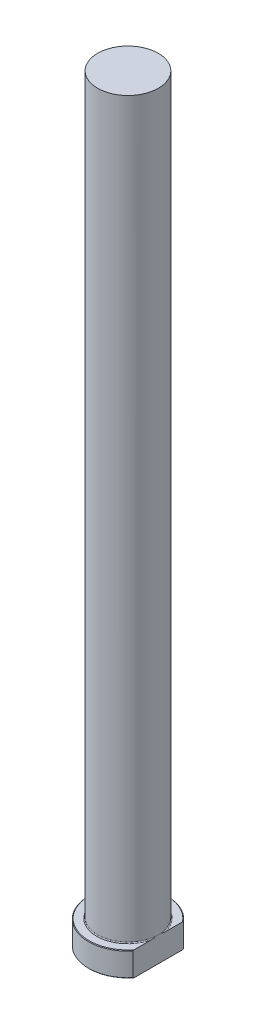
ISO-10303-21;
HEADER;
FILE_DESCRIPTION(('STEP AP214'),'2;1');
FILE_NAME('part.step','',(''),(''),'','','');
FILE_SCHEMA(('AUTOMOTIVE_DESIGN { 1 0 10303 214 1 1 1 1 }'));
ENDSEC;
DATA;
#1=APPLICATION_CONTEXT('core data for automotive mechanical design processes');
#2=APPLICATION_PROTOCOL_DEFINITION('international standard','automotive_design',2000,#1);
#3=PRODUCT_CONTEXT('',#1,'mechanical');
#4=PRODUCT('Part','Part','',(#3));
#5=PRODUCT_RELATED_PRODUCT_CATEGORY('part','',(#4));
#6=PRODUCT_DEFINITION_FORMATION('','',#4);
#7=PRODUCT_DEFINITION_CONTEXT('part definition',#1,'design');
#8=PRODUCT_DEFINITION('design','',#6,#7);
#9=PRODUCT_DEFINITION_SHAPE('','',#8);
#10=(LENGTH_UNIT() NAMED_UNIT(*) SI_UNIT(.MILLI.,.METRE.));
#11=(NAMED_UNIT(*) PLANE_ANGLE_UNIT() SI_UNIT($,.RADIAN.));
#12=(NAMED_UNIT(*) SI_UNIT($,.STERADIAN.) SOLID_ANGLE_UNIT());
#13=UNCERTAINTY_MEASURE_WITH_UNIT(LENGTH_MEASURE(1.E-05),#10,'distance_accuracy_value','');
#14=(GEOMETRIC_REPRESENTATION_CONTEXT(3) GLOBAL_UNCERTAINTY_ASSIGNED_CONTEXT((#13)) GLOBAL_UNIT_ASSIGNED_CONTEXT((#10,
#11,#12)) REPRESENTATION_CONTEXT('',''));
#15=CARTESIAN_POINT('',(0.,0.,0.));
#16=DIRECTION('',(0.,0.,1.));
#17=DIRECTION('',(1.,0.,0.));
#18=AXIS2_PLACEMENT_3D('',#15,#16,#17);
#19=CARTESIAN_POINT('',(0.,0.,0.));
#20=DIRECTION('',(0.,-1.,0.));
#21=DIRECTION('',(0.,0.,-1.));
#22=AXIS2_PLACEMENT_3D('',#19,#20,#21);
#23=PLANE('',#22);
#24=CARTESIAN_POINT('',(0.,0.,0.));
#25=DIRECTION('',(0.,-1.,0.));
#26=DIRECTION('',(0.,0.,-1.));
#27=AXIS2_PLACEMENT_3D('',#24,#25,#26);
#28=CIRCLE('',#27,12.8);
#29=CARTESIAN_POINT('',(9.99999999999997,0.,7.98999374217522));
#30=VERTEX_POINT('',#29);
#31=CARTESIAN_POINT('',(9.99999999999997,0.,-7.98999374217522));
#32=VERTEX_POINT('',#31);
#33=EDGE_CURVE('E98',#30,#32,#28,.T.);
#34=ORIENTED_EDGE('',*,*,#33,.T.);
#35=DIRECTION('',(0.,0.,1.));
#36=VECTOR('',#35,1.);
#37=CARTESIAN_POINT('',(9.99999999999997,0.,-8.30662386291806));
#38=LINE('',#37,#36);
#39=EDGE_CURVE('E83',#32,#30,#38,.T.);
#40=ORIENTED_EDGE('',*,*,#39,.T.);
#41=EDGE_LOOP('',(#34,#40));
#42=FACE_BOUND('',#41,.T.);
#43=ADVANCED_FACE('F32',(#42),#23,.T.);
#44=CARTESIAN_POINT('',(0.,259.958771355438,0.));
#45=DIRECTION('',(0.,1.,0.));
#46=DIRECTION('',(0.,0.,1.));
#47=AXIS2_PLACEMENT_3D('',#44,#45,#46);
#48=CYLINDRICAL_SURFACE('',#47,13.);
#49=CARTESIAN_POINT('',(0.,7.79999999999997,0.));
#50=DIRECTION('',(0.,1.,0.));
#51=DIRECTION('',(0.,0.,1.));
#52=AXIS2_PLACEMENT_3D('',#49,#50,#51);
#53=CIRCLE('',#52,13.);
#54=CARTESIAN_POINT('',(9.99999999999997,7.79999999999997,8.30662386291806));
#55=VERTEX_POINT('',#54);
#56=CARTESIAN_POINT('',(9.99999999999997,7.79999999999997,-8.30662386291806));
#57=VERTEX_POINT('',#56);
#58=EDGE_CURVE('E104',#55,#57,#53,.F.);
#59=ORIENTED_EDGE('',*,*,#58,.T.);
#60=DIRECTION('',(0.,-1.,0.));
#61=VECTOR('',#60,1.);
#62=CARTESIAN_POINT('',(9.99999999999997,250.,-8.30662386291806));
#63=LINE('',#62,#61);
#64=CARTESIAN_POINT('',(9.99999999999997,0.199999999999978,-8.30662386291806));
#65=VERTEX_POINT('',#64);
#66=EDGE_CURVE('E183',#57,#65,#63,.T.);
#67=ORIENTED_EDGE('',*,*,#66,.T.);
#68=CARTESIAN_POINT('',(0.,0.199999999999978,0.));
#69=DIRECTION('',(0.,-1.,0.));
#70=DIRECTION('',(0.,0.,-1.));
#71=AXIS2_PLACEMENT_3D('',#68,#69,#70);
#72=CIRCLE('',#71,13.);
#73=CARTESIAN_POINT('',(9.99999999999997,0.199999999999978,8.30662386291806));
#74=VERTEX_POINT('',#73);
#75=EDGE_CURVE('E100',#65,#74,#72,.F.);
#76=ORIENTED_EDGE('',*,*,#75,.T.);
#77=DIRECTION('',(0.,-1.,0.));
#78=VECTOR('',#77,1.);
#79=CARTESIAN_POINT('',(9.99999999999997,250.,8.30662386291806));
#80=LINE('',#79,#78);
#81=EDGE_CURVE('E93',#55,#74,#80,.T.);
#82=ORIENTED_EDGE('',*,*,#81,.F.);
#83=EDGE_LOOP('',(#59,#67,#76,#82));
#84=FACE_BOUND('',#83,.T.);
#85=ADVANCED_FACE('F158',(#84),#48,.T.);
#86=CARTESIAN_POINT('',(-13.,8.,0.));
#87=DIRECTION('',(0.,1.,0.));
#88=DIRECTION('',(0.,0.,1.));
#89=AXIS2_PLACEMENT_3D('',#86,#87,#88);
#90=PLANE('',#89);
#91=CARTESIAN_POINT('',(0.,8.,0.));
#92=DIRECTION('',(0.,1.,0.));
#93=DIRECTION('',(0.,0.,1.));
#94=AXIS2_PLACEMENT_3D('',#91,#92,#93);
#95=CIRCLE('',#94,12.8);
#96=CARTESIAN_POINT('',(9.99999999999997,8.,-7.98999374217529));
#97=VERTEX_POINT('',#96);
#98=CARTESIAN_POINT('',(9.99999999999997,8.,7.98999374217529));
#99=VERTEX_POINT('',#98);
#100=EDGE_CURVE('E178',#97,#99,#95,.T.);
#101=ORIENTED_EDGE('',*,*,#100,.T.);
#102=DIRECTION('',(0.,0.,-1.));
#103=VECTOR('',#102,1.);
#104=CARTESIAN_POINT('',(9.99999999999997,8.,0.));
#105=LINE('',#104,#103);
#106=CARTESIAN_POINT('',(9.99999999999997,7.99999999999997,2.46779253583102));
#107=VERTEX_POINT('',#106);
#108=EDGE_CURVE('E57',#99,#107,#105,.T.);
#109=ORIENTED_EDGE('',*,*,#108,.T.);
#110=CARTESIAN_POINT('',(0.,8.,0.));
#111=DIRECTION('',(0.,1.,0.));
#112=DIRECTION('',(0.,0.,1.));
#113=AXIS2_PLACEMENT_3D('',#110,#111,#112);
#114=CIRCLE('',#113,10.3);
#115=CARTESIAN_POINT('',(9.99999999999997,7.99999999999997,-2.4677925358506));
#116=VERTEX_POINT('',#115);
#117=EDGE_CURVE('E107',#107,#116,#114,.F.);
#118=ORIENTED_EDGE('',*,*,#117,.T.);
#119=EDGE_CURVE('E136',#116,#97,#105,.T.);
#120=ORIENTED_EDGE('',*,*,#119,.T.);
#121=EDGE_LOOP('',(#101,#109,#118,#120));
#122=FACE_BOUND('',#121,.T.);
#123=ADVANCED_FACE('F147',(#122),#90,.T.);
#124=CARTESIAN_POINT('',(0.,8.00000000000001,0.));
#125=DIRECTION('',(0.,-1.,0.));
#126=DIRECTION('',(0.,0.,-1.));
#127=AXIS2_PLACEMENT_3D('',#124,#125,#126);
#128=CONICAL_SURFACE('',#127,12.8,0.78539816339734);
#129=ORIENTED_EDGE('',*,*,#58,.F.);
#130=CARTESIAN_POINT('',(9.99999999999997,-0.0325156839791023,18.2754947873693));
#131=CARTESIAN_POINT('',(9.99999999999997,0.202654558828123,18.0074110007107));
#132=CARTESIAN_POINT('',(9.99999999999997,0.437161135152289,17.7387434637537));
#133=CARTESIAN_POINT('',(9.99999999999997,0.90465320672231,17.2000818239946));
#134=CARTESIAN_POINT('',(9.99999999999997,1.1376386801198,16.9300877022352));
#135=CARTESIAN_POINT('',(9.99999999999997,1.60198918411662,16.3885035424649));
#136=CARTESIAN_POINT('',(9.99999999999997,1.83335346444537,16.1169128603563));
#137=CARTESIAN_POINT('',(9.99999999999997,2.29410614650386,15.5720644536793));
#138=CARTESIAN_POINT('',(9.99999999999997,2.52349455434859,15.2988067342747));
#139=CARTESIAN_POINT('',(9.99999999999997,3.21725580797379,14.465453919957));
#140=CARTESIAN_POINT('',(9.99999999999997,3.67808931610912,13.9023903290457));
#141=CARTESIAN_POINT('',(9.99999999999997,4.35978968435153,13.0502618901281));
#142=CARTESIAN_POINT('',(9.99999999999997,4.58540795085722,12.7649943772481));
#143=CARTESIAN_POINT('',(9.99999999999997,5.03290011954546,12.1915402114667));
#144=CARTESIAN_POINT('',(9.99999999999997,5.25477408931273,11.9033536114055));
#145=CARTESIAN_POINT('',(9.99999999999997,5.69431250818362,11.3233226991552));
#146=CARTESIAN_POINT('',(9.99999999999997,5.91197246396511,11.0314749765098));
#147=CARTESIAN_POINT('',(9.99999999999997,6.3419766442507,10.4438760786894));
#148=CARTESIAN_POINT('',(9.99999999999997,6.55432081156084,10.1481248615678));
#149=CARTESIAN_POINT('',(9.99999999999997,6.97275454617,9.55185224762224));
#150=CARTESIAN_POINT('',(9.99999999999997,7.1788387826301,9.25132709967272));
#151=CARTESIAN_POINT('',(9.99999999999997,7.58314110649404,8.6450223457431));
#152=CARTESIAN_POINT('',(9.99999999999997,7.78135936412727,8.33924285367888));
#153=CARTESIAN_POINT('',(9.99999999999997,8.1669913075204,7.72335702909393));
#154=CARTESIAN_POINT('',(9.99999999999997,8.35446043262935,7.41328556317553));
#155=CARTESIAN_POINT('',(9.99999999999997,8.71750578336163,6.78616658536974));
#156=CARTESIAN_POINT('',(9.99999999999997,8.89308056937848,6.46911823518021));
#157=CARTESIAN_POINT('',(9.99999999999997,9.22907765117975,5.82759086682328));
#158=CARTESIAN_POINT('',(9.99999999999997,9.38952050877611,5.50312269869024));
#159=CARTESIAN_POINT('',(9.99999999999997,9.69166927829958,4.84563633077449));
#160=CARTESIAN_POINT('',(9.99999999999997,9.83338220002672,4.5126213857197));
#161=CARTESIAN_POINT('',(9.99999999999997,10.096522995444,3.82962418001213));
#162=CARTESIAN_POINT('',(9.99999999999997,10.2174003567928,3.47942732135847));
#163=CARTESIAN_POINT('',(9.99999999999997,10.4289934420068,2.76986167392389));
#164=CARTESIAN_POINT('',(9.99999999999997,10.5197138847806,2.41049432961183));
#165=CARTESIAN_POINT('',(9.99999999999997,10.6286544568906,1.86748514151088));
#166=CARTESIAN_POINT('',(9.99999999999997,10.6603769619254,1.68649705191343));
#167=CARTESIAN_POINT('',(9.99999999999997,10.7144435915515,1.32313476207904));
#168=CARTESIAN_POINT('',(9.99999999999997,10.7367891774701,1.14076078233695));
#169=CARTESIAN_POINT('',(9.99999999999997,10.7716587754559,0.775084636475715));
#170=CARTESIAN_POINT('',(9.99999999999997,10.7841833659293,0.591782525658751));
#171=CARTESIAN_POINT('',(9.99999999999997,10.7991548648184,0.224764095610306));
#172=CARTESIAN_POINT('',(9.99999999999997,10.8016017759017,0.0410477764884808));
#173=CARTESIAN_POINT('',(9.99999999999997,10.7963538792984,-0.32701731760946));
#174=CARTESIAN_POINT('',(9.99999999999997,10.7886160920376,-0.511365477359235));
#175=CARTESIAN_POINT('',(9.99999999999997,10.7630873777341,-0.879387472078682));
#176=CARTESIAN_POINT('',(9.99999999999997,10.7452949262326,-1.06306120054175));
#177=CARTESIAN_POINT('',(9.99999999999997,10.7000178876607,-1.42920996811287));
#178=CARTESIAN_POINT('',(9.99999999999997,10.6725330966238,-1.61168498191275));
#179=CARTESIAN_POINT('',(9.99999999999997,10.6083992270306,-1.97502817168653));
#180=CARTESIAN_POINT('',(9.99999999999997,10.5717486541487,-2.15589608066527));
#181=CARTESIAN_POINT('',(9.99999999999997,10.4483311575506,-2.69844589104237));
#182=CARTESIAN_POINT('',(9.99999999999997,10.3484702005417,-3.0571987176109));
#183=CARTESIAN_POINT('',(9.99999999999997,10.1199208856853,-3.76518322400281));
#184=CARTESIAN_POINT('',(9.99999999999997,9.99123071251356,-4.11441430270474));
#185=CARTESIAN_POINT('',(9.99999999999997,9.68849468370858,-4.85781703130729));
#186=CARTESIAN_POINT('',(9.99999999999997,9.51049481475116,-5.25036497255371));
#187=CARTESIAN_POINT('',(9.99999999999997,9.13067200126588,-6.0238543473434));
#188=CARTESIAN_POINT('',(9.99999999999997,8.92883580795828,-6.40478917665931));
#189=CARTESIAN_POINT('',(9.99999999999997,8.50660482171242,-7.15714025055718));
#190=CARTESIAN_POINT('',(9.99999999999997,8.28617401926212,-7.52853612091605));
#191=CARTESIAN_POINT('',(9.99999999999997,7.83133827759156,-8.26251132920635));
#192=CARTESIAN_POINT('',(9.99999999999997,7.59693601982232,-8.62509234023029));
#193=CARTESIAN_POINT('',(9.99999999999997,7.11586721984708,-9.34492022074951));
#194=CARTESIAN_POINT('',(9.99999999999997,6.86913954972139,-9.7021260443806));
#195=CARTESIAN_POINT('',(9.99999999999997,6.36695123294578,-10.4103413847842));
#196=CARTESIAN_POINT('',(9.99999999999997,6.11149026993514,-10.7613506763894));
#197=CARTESIAN_POINT('',(9.99999999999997,5.59387477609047,-11.4577672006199));
#198=CARTESIAN_POINT('',(9.99999999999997,5.33172815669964,-11.803180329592));
#199=CARTESIAN_POINT('',(9.99999999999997,4.80177954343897,-12.4896197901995));
#200=CARTESIAN_POINT('',(9.99999999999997,4.53397765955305,-12.8306462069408));
#201=CARTESIAN_POINT('',(9.99999999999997,3.91508653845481,-13.6077378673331));
#202=CARTESIAN_POINT('',(9.99999999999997,3.56244770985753,-14.0425677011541));
#203=CARTESIAN_POINT('',(9.99999999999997,2.85099084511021,-14.9072873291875));
#204=CARTESIAN_POINT('',(9.99999999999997,2.49217148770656,-15.3371760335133));
#205=CARTESIAN_POINT('',(9.99999999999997,1.77449197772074,-16.1870689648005));
#206=CARTESIAN_POINT('',(9.99999999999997,1.41569709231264,-16.607128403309));
#207=CARTESIAN_POINT('',(9.99999999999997,0.694277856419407,-17.4437464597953));
#208=CARTESIAN_POINT('',(9.99999999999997,0.331654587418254,-17.8603060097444));
#209=CARTESIAN_POINT('',(9.99999999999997,-0.0325156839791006,-18.2754947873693));
#210=B_SPLINE_CURVE_WITH_KNOTS('',3,(#130,#131,#132,#133,#134,#135,#136,#137,#138,#139,#140,
#141,#142,#143,#144,#145,#146,#147,#148,#149,#150,#151,#152,#153,#154,#155,#156,#157,#158,#159,
#160,#161,#162,#163,#164,#165,#166,#167,#168,#169,#170,#171,#172,#173,#174,#175,#176,#177,#178,
#179,#180,#181,#182,#183,#184,#185,#186,#187,#188,#189,#190,#191,#192,#193,#194,#195,#196,#197,
#198,#199,#200,#201,#202,#203,#204,#205,#206,#207,#208,#209),.UNSPECIFIED.,.F.,.F.,(4,2,2,2,2,2,
2,2,2,2,2,2,2,2,2,2,2,2,2,2,2,2,2,2,2,2,2,2,2,2,2,2,2,2,2,2,2,2,2,4),(0.,1.06984422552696,
2.13970378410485,3.21002948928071,4.28035188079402,6.46299853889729,7.55408928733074,
8.64516032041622,9.73733693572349,10.8295252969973,11.9226190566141,13.0156891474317,
14.1024911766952,15.1894245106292,16.2748589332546,17.3598859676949,18.4702319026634,
19.5804040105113,20.1314403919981,20.6823908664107,21.2333088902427,21.7842267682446,
22.3374769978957,22.890811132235,23.4441569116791,23.9975929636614,25.1131246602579,
26.2287266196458,27.520697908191,28.8133907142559,30.1086470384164,31.4036555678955,
32.7058891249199,34.0081699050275,35.3089752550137,36.6097553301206,38.2892289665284,
39.9690662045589,41.6263430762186,43.2831636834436),.UNSPECIFIED.);
#211=EDGE_CURVE('E135',#55,#99,#210,.T.);
#212=ORIENTED_EDGE('',*,*,#211,.T.);
#213=ORIENTED_EDGE('',*,*,#100,.F.);
#214=EDGE_CURVE('E127',#97,#57,#210,.T.);
#215=ORIENTED_EDGE('',*,*,#214,.T.);
#216=EDGE_LOOP('',(#129,#212,#213,#215));
#217=FACE_BOUND('',#216,.T.);
#218=ADVANCED_FACE('F143',(#217),#128,.T.);
#219=CARTESIAN_POINT('',(0.,0.199999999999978,0.));
#220=DIRECTION('',(0.,1.,0.));
#221=DIRECTION('',(0.,0.,1.));
#222=AXIS2_PLACEMENT_3D('',#219,#220,#221);
#223=CONICAL_SURFACE('',#222,13.,0.785398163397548);
#224=ORIENTED_EDGE('',*,*,#75,.F.);
#225=CARTESIAN_POINT('',(9.99999999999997,8.0325156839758,-18.2754947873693));
#226=CARTESIAN_POINT('',(9.99999999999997,7.7973454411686,-18.0074110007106));
#227=CARTESIAN_POINT('',(9.99999999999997,7.56283886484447,-17.7387434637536));
#228=CARTESIAN_POINT('',(9.99999999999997,7.09534679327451,-17.2000818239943));
#229=CARTESIAN_POINT('',(9.99999999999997,6.86236131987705,-16.9300877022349));
#230=CARTESIAN_POINT('',(9.99999999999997,6.3980108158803,-16.3885035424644));
#231=CARTESIAN_POINT('',(9.99999999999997,6.16664653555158,-16.1169128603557));
#232=CARTESIAN_POINT('',(9.99999999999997,5.70589385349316,-15.5720644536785));
#233=CARTESIAN_POINT('',(9.99999999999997,5.47650544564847,-15.2988067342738));
#234=CARTESIAN_POINT('',(9.99999999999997,4.78274419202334,-14.4654539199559));
#235=CARTESIAN_POINT('',(9.99999999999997,4.32191068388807,-13.9023903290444));
#236=CARTESIAN_POINT('',(9.99999999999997,3.64021031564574,-13.0502618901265));
#237=CARTESIAN_POINT('',(9.99999999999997,3.41459204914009,-12.7649943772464));
#238=CARTESIAN_POINT('',(9.99999999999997,2.96709988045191,-12.1915402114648));
#239=CARTESIAN_POINT('',(9.99999999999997,2.74522591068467,-11.9033536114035));
#240=CARTESIAN_POINT('',(9.99999999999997,2.30568749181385,-11.323322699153));
#241=CARTESIAN_POINT('',(9.99999999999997,2.08802753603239,-11.0314749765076));
#242=CARTESIAN_POINT('',(9.99999999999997,1.65802335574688,-10.4438760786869));
#243=CARTESIAN_POINT('',(9.99999999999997,1.44567918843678,-10.1481248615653));
#244=CARTESIAN_POINT('',(9.99999999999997,1.02724545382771,-9.5518522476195));
#245=CARTESIAN_POINT('',(9.99999999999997,0.821161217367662,-9.25132709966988));
#246=CARTESIAN_POINT('',(9.99999999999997,0.416858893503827,-8.64502234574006));
#247=CARTESIAN_POINT('',(9.99999999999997,0.218640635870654,-8.33924285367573));
#248=CARTESIAN_POINT('',(9.99999999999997,-0.166991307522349,-7.72335702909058));
#249=CARTESIAN_POINT('',(9.99999999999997,-0.35446043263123,-7.41328556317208));
#250=CARTESIAN_POINT('',(9.99999999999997,-0.717505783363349,-6.78616658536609));
#251=CARTESIAN_POINT('',(9.99999999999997,-0.89308056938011,-6.46911823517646));
#252=CARTESIAN_POINT('',(9.99999999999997,-1.2290776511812,-5.82759086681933));
#253=CARTESIAN_POINT('',(9.99999999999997,-1.38952050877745,-5.50312269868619));
#254=CARTESIAN_POINT('',(9.99999999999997,-1.6916692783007,-4.84563633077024));
#255=CARTESIAN_POINT('',(9.99999999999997,-1.83338220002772,-4.51262138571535));
#256=CARTESIAN_POINT('',(9.99999999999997,-2.09652299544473,-3.8296241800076));
#257=CARTESIAN_POINT('',(9.99999999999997,-2.21740035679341,-3.47942732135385));
#258=CARTESIAN_POINT('',(9.99999999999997,-2.42899344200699,-2.76986167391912));
#259=CARTESIAN_POINT('',(9.99999999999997,-2.51971388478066,-2.41049432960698));
#260=CARTESIAN_POINT('',(9.99999999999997,-2.62865445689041,-1.86748514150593));
#261=CARTESIAN_POINT('',(9.99999999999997,-2.66037696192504,-1.68649705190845));
#262=CARTESIAN_POINT('',(9.99999999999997,-2.71444359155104,-1.323134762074));
#263=CARTESIAN_POINT('',(9.99999999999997,-2.73678917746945,-1.14076078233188));
#264=CARTESIAN_POINT('',(9.99999999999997,-2.77165877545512,-0.775084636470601));
#265=CARTESIAN_POINT('',(9.99999999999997,-2.78418336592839,-0.591782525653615));
#266=CARTESIAN_POINT('',(9.99999999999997,-2.7991548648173,-0.224764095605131));
#267=CARTESIAN_POINT('',(9.99999999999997,-2.80160177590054,-0.0410477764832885));
#268=CARTESIAN_POINT('',(9.99999999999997,-2.79635387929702,0.327017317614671));
#269=CARTESIAN_POINT('',(9.99999999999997,-2.78861609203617,0.511365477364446));
#270=CARTESIAN_POINT('',(9.99999999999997,-2.76308737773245,0.879387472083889));
#271=CARTESIAN_POINT('',(9.99999999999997,-2.74529492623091,1.06306120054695));
#272=CARTESIAN_POINT('',(9.99999999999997,-2.70001788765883,1.42920996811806));
#273=CARTESIAN_POINT('',(9.99999999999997,-2.67253309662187,1.61168498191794));
#274=CARTESIAN_POINT('',(9.99999999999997,-2.60839922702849,1.9750281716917));
#275=CARTESIAN_POINT('',(9.99999999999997,-2.57174865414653,2.15589608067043));
#276=CARTESIAN_POINT('',(9.99999999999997,-2.44833115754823,2.6984458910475));
#277=CARTESIAN_POINT('',(9.99999999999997,-2.34847020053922,3.057198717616));
#278=CARTESIAN_POINT('',(9.99999999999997,-2.11992088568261,3.76518322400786));
#279=CARTESIAN_POINT('',(9.99999999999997,-1.99123071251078,4.11441430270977));
#280=CARTESIAN_POINT('',(9.99999999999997,-1.68849468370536,4.85781703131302));
#281=CARTESIAN_POINT('',(9.99999999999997,-1.51049481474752,5.25036497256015));
#282=CARTESIAN_POINT('',(9.99999999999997,-1.13067200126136,6.02385434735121));
#283=CARTESIAN_POINT('',(9.99999999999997,-0.928835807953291,6.4047891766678));
#284=CARTESIAN_POINT('',(9.99999999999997,-0.506604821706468,7.15714025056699));
#285=CARTESIAN_POINT('',(9.99999999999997,-0.286174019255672,7.52853612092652));
#286=CARTESIAN_POINT('',(9.99999999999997,0.16866172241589,8.26251132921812));
#287=CARTESIAN_POINT('',(9.99999999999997,0.403063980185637,8.62509234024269));
#288=CARTESIAN_POINT('',(9.99999999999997,0.884132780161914,9.34492022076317));
#289=CARTESIAN_POINT('',(9.99999999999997,1.13086045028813,9.7021260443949));
#290=CARTESIAN_POINT('',(9.99999999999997,1.63304876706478,10.4103413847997));
#291=CARTESIAN_POINT('',(9.99999999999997,1.88850973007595,10.7613506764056));
#292=CARTESIAN_POINT('',(9.99999999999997,2.40612522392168,11.4577672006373));
#293=CARTESIAN_POINT('',(9.99999999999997,2.66827184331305,11.80318032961));
#294=CARTESIAN_POINT('',(9.99999999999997,3.19822045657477,12.4896197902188));
#295=CARTESIAN_POINT('',(9.99999999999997,3.46602234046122,12.8306462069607));
#296=CARTESIAN_POINT('',(9.99999999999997,4.08491346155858,13.6077378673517));
#297=CARTESIAN_POINT('',(9.99999999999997,4.4375522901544,14.042567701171));
#298=CARTESIAN_POINT('',(9.99999999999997,5.14900915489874,14.9072873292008));
#299=CARTESIAN_POINT('',(9.99999999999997,5.50782851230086,15.3371760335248));
#300=CARTESIAN_POINT('',(9.99999999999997,6.22550802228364,16.1870689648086));
#301=CARTESIAN_POINT('',(9.99999999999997,6.58430290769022,16.6071284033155));
#302=CARTESIAN_POINT('',(9.99999999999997,7.30572214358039,17.4437464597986));
#303=CARTESIAN_POINT('',(9.99999999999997,7.66834541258,17.8603060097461));
#304=CARTESIAN_POINT('',(9.99999999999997,8.0325156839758,18.2754947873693));
#305=B_SPLINE_CURVE_WITH_KNOTS('',3,(#225,#226,#227,#228,#229,#230,#231,#232,#233,#234,#235,
#236,#237,#238,#239,#240,#241,#242,#243,#244,#245,#246,#247,#248,#249,#250,#251,#252,#253,#254,
#255,#256,#257,#258,#259,#260,#261,#262,#263,#264,#265,#266,#267,#268,#269,#270,#271,#272,#273,
#274,#275,#276,#277,#278,#279,#280,#281,#282,#283,#284,#285,#286,#287,#288,#289,#290,#291,#292,
#293,#294,#295,#296,#297,#298,#299,#300,#301,#302,#303,#304),.UNSPECIFIED.,.F.,.F.,(4,2,2,2,2,2,
2,2,2,2,2,2,2,2,2,2,2,2,2,2,2,2,2,2,2,2,2,2,2,2,2,2,2,2,2,2,2,2,2,4),(0.,1.06984422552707,
2.13970378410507,3.21002948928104,4.28035188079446,6.46299853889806,7.55408928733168,
8.64516032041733,9.73733693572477,10.8295252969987,11.9226190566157,13.0156891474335,
14.1024911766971,15.1894245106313,16.2748589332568,17.3598859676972,18.4702319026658,
19.5804040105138,20.1314403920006,20.6823908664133,21.2333088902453,21.7842267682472,
22.3374769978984,22.8908111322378,23.4441569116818,23.9975929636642,25.1131246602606,
26.2287266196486,27.5206979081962,28.8133907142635,30.1086470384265,31.4036555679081,
32.7058891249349,34.0081699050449,35.3089752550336,36.6097553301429,38.2892289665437,
39.9690662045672,41.6263430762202,43.2831636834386),.UNSPECIFIED.);
#306=EDGE_CURVE('E86',#65,#32,#305,.T.);
#307=ORIENTED_EDGE('',*,*,#306,.T.);
#308=ORIENTED_EDGE('',*,*,#33,.F.);
#309=EDGE_CURVE('E89',#30,#74,#305,.T.);
#310=ORIENTED_EDGE('',*,*,#309,.T.);
#311=EDGE_LOOP('',(#224,#307,#308,#310));
#312=FACE_BOUND('',#311,.T.);
#313=ADVANCED_FACE('F97',(#312),#223,.T.);
#314=CARTESIAN_POINT('',(0.,8.29999999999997,0.));
#315=DIRECTION('',(0.,1.,0.));
#316=DIRECTION('',(0.,0.,1.));
#317=AXIS2_PLACEMENT_3D('',#314,#315,#316);
#318=TOROIDAL_SURFACE('',#317,10.3,0.3);
#319=CARTESIAN_POINT('',(9.99999999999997,8.29999999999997,0.));
#320=CARTESIAN_POINT('',(9.99999999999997,8.3000006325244,1.2894927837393E-10));
#321=CARTESIAN_POINT('',(9.99999999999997,8.30000126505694,-4.00092931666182E-07));
#322=CARTESIAN_POINT('',(9.99999999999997,8.30000243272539,-1.40234418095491E-06));
#323=CARTESIAN_POINT('',(9.99999999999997,8.30000291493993,-2.02945823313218E-06));
#324=CARTESIAN_POINT('',(9.99999999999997,8.30000399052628,-3.57386628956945E-06));
#325=CARTESIAN_POINT('',(9.99999999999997,8.30000456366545,-4.5158581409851E-06));
#326=CARTESIAN_POINT('',(9.99999999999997,8.30000552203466,-6.39352358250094E-06));
#327=CARTESIAN_POINT('',(9.99999999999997,8.3000059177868,-7.32481303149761E-06));
#328=CARTESIAN_POINT('',(9.99999999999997,8.30000752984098,-1.11866731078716E-05));
#329=CARTESIAN_POINT('',(9.99999999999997,8.30000869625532,-1.41456078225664E-05));
#330=CARTESIAN_POINT('',(9.99999999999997,8.30001046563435,-1.98041770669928E-05));
#331=CARTESIAN_POINT('',(9.99999999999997,8.30001112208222,-2.2487618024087E-05));
#332=CARTESIAN_POINT('',(9.99999999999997,8.30001410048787,-3.44834818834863E-05));
#333=CARTESIAN_POINT('',(9.99999999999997,8.30001652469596,-4.37702043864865E-05));
#334=CARTESIAN_POINT('',(9.99999999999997,8.30001986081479,-6.08623690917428E-05));
#335=CARTESIAN_POINT('',(9.99999999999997,8.30002096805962,-6.86285921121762E-05));
#336=CARTESIAN_POINT('',(9.99999999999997,8.3000293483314,-0.00012805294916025));
#337=CARTESIAN_POINT('',(9.99999999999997,8.30003610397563,-0.000179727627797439));
#338=CARTESIAN_POINT('',(9.99999999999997,8.30006561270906,-0.00038619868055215));
#339=CARTESIAN_POINT('',(9.99999999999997,8.30009331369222,-0.000540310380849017));
#340=CARTESIAN_POINT('',(9.99999999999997,8.30020264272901,-0.00115673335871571));
#341=CARTESIAN_POINT('',(9.99999999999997,8.30028138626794,-0.00161935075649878));
#342=CARTESIAN_POINT('',(9.99999999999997,8.30059961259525,-0.00347761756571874));
#343=CARTESIAN_POINT('',(9.99999999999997,8.30084290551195,-0.0048728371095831));
#344=CARTESIAN_POINT('',(9.99999999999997,8.30186502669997,-0.0107472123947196));
#345=CARTESIAN_POINT('',(9.99999999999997,8.30263902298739,-0.0152269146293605));
#346=CARTESIAN_POINT('',(9.99999999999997,8.31278939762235,-0.0739588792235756));
#347=CARTESIAN_POINT('',(9.99999999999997,8.32219581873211,-0.128207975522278));
#348=CARTESIAN_POINT('',(9.99999999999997,8.34198671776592,-0.242894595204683));
#349=CARTESIAN_POINT('',(9.99999999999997,8.35236068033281,-0.303333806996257));
#350=CARTESIAN_POINT('',(9.99999999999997,8.3697713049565,-0.405616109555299));
#351=CARTESIAN_POINT('',(9.99999999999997,8.3768514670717,-0.447451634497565));
#352=CARTESIAN_POINT('',(9.99999999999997,8.39069208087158,-0.529918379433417));
#353=CARTESIAN_POINT('',(9.99999999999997,8.39745582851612,-0.570549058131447));
#354=CARTESIAN_POINT('',(9.99999999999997,8.4352494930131,-0.799879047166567));
#355=CARTESIAN_POINT('',(9.99999999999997,8.46492511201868,-0.988816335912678));
#356=CARTESIAN_POINT('',(9.99999999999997,8.50514159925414,-1.27416595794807));
#357=CARTESIAN_POINT('',(9.99999999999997,8.51790226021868,-1.37026272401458));
#358=CARTESIAN_POINT('',(9.99999999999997,8.54137601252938,-1.56269877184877));
#359=CARTESIAN_POINT('',(9.99999999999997,8.55208934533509,-1.65903802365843));
#360=CARTESIAN_POINT('',(9.99999999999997,8.57171635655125,-1.86082905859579));
#361=CARTESIAN_POINT('',(9.99999999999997,8.58037484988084,-1.96630619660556));
#362=CARTESIAN_POINT('',(9.99999999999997,8.59347501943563,-2.17764173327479));
#363=CARTESIAN_POINT('',(9.99999999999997,8.59791297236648,-2.28350038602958));
#364=CARTESIAN_POINT('',(9.99999999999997,8.60018116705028,-2.44194031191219));
#365=CARTESIAN_POINT('',(9.99999999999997,8.60021412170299,-2.49449016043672));
#366=CARTESIAN_POINT('',(9.99999999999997,8.5985468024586,-2.59955991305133));
#367=CARTESIAN_POINT('',(9.99999999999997,8.59684676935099,-2.65207982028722));
#368=CARTESIAN_POINT('',(9.99999999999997,8.59132943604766,-2.7569292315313));
#369=CARTESIAN_POINT('',(9.99999999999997,8.58751547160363,-2.80925890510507));
#370=CARTESIAN_POINT('',(9.99999999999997,8.57721394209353,-2.91364681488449));
#371=CARTESIAN_POINT('',(9.99999999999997,8.57072778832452,-2.96570517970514));
#372=CARTESIAN_POINT('',(9.99999999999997,8.55845909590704,-3.04236198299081));
#373=CARTESIAN_POINT('',(9.99999999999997,8.55406015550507,-3.06718232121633));
#374=CARTESIAN_POINT('',(9.99999999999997,8.54426309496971,-3.11664708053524));
#375=CARTESIAN_POINT('',(9.99999999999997,8.53886425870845,-3.14129136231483));
#376=CARTESIAN_POINT('',(9.99999999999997,8.52688550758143,-3.19015398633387));
#377=CARTESIAN_POINT('',(9.99999999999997,8.52031210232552,-3.21437390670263));
#378=CARTESIAN_POINT('',(9.99999999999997,8.50565284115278,-3.26234404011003));
#379=CARTESIAN_POINT('',(9.99999999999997,8.49756823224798,-3.2860946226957));
#380=CARTESIAN_POINT('',(9.99999999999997,8.47930616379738,-3.33303874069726));
#381=CARTESIAN_POINT('',(9.99999999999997,8.46910978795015,-3.35622496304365));
#382=CARTESIAN_POINT('',(9.99999999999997,8.44583688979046,-3.40109767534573));
#383=CARTESIAN_POINT('',(9.99999999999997,8.43277518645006,-3.4227911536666));
#384=CARTESIAN_POINT('',(9.99999999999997,8.41234422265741,-3.44947282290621));
#385=CARTESIAN_POINT('',(9.99999999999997,8.40696910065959,-3.45597309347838));
#386=CARTESIAN_POINT('',(9.99999999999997,8.39560437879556,-3.46843629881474));
#387=CARTESIAN_POINT('',(9.99999999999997,8.38961405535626,-3.47439858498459));
#388=CARTESIAN_POINT('',(9.99999999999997,8.37686927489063,-3.48560282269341));
#389=CARTESIAN_POINT('',(9.99999999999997,8.37010747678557,-3.49083658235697));
#390=CARTESIAN_POINT('',(9.99999999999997,8.3558159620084,-3.50012893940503));
#391=CARTESIAN_POINT('',(9.99999999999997,8.34828839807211,-3.50419071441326));
#392=CARTESIAN_POINT('',(9.99999999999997,8.33495256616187,-3.50966904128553));
#393=CARTESIAN_POINT('',(9.99999999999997,8.32932210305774,-3.5115146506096));
#394=CARTESIAN_POINT('',(9.99999999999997,8.31783314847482,-3.51424608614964));
#395=CARTESIAN_POINT('',(9.99999999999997,8.31197492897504,-3.5151330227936));
#396=CARTESIAN_POINT('',(9.99999999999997,8.30017128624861,-3.51585458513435));
#397=CARTESIAN_POINT('',(9.99999999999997,8.29422562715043,-3.5156854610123));
#398=CARTESIAN_POINT('',(9.99999999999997,8.28245600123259,-3.5143060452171));
#399=CARTESIAN_POINT('',(9.99999999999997,8.2766321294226,-3.51309496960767));
#400=CARTESIAN_POINT('',(9.99999999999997,8.26408629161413,-3.50941038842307));
#401=CARTESIAN_POINT('',(9.99999999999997,8.25742641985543,-3.50672823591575));
#402=CARTESIAN_POINT('',(9.99999999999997,8.2446282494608,-3.50032629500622));
#403=CARTESIAN_POINT('',(9.99999999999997,8.23849100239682,-3.49660447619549));
#404=CARTESIAN_POINT('',(9.99999999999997,8.22322836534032,-3.48593836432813));
#405=CARTESIAN_POINT('',(9.99999999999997,8.21452212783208,-3.47840118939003));
#406=CARTESIAN_POINT('',(9.99999999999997,8.19829740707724,-3.46215047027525));
#407=CARTESIAN_POINT('',(9.99999999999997,8.19078248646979,-3.45343353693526));
#408=CARTESIAN_POINT('',(9.99999999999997,8.16907103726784,-3.42543186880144));
#409=CARTESIAN_POINT('',(9.99999999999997,8.15646161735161,-3.40493410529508));
#410=CARTESIAN_POINT('',(9.99999999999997,8.13394130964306,-3.36256849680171));
#411=CARTESIAN_POINT('',(9.99999999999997,8.12403585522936,-3.34069800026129));
#412=CARTESIAN_POINT('',(9.99999999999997,8.10001076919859,-3.28102790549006));
#413=CARTESIAN_POINT('',(9.99999999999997,8.08762395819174,-3.24253659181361));
#414=CARTESIAN_POINT('',(9.99999999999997,8.06625855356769,-3.16459452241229));
#415=CARTESIAN_POINT('',(9.99999999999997,8.05728845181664,-3.12514163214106));
#416=CARTESIAN_POINT('',(9.99999999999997,8.04173697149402,-3.04517405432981));
#417=CARTESIAN_POINT('',(9.99999999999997,8.03519245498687,-3.00465227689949));
#418=CARTESIAN_POINT('',(9.99999999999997,8.02409415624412,-2.9234105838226));
#419=CARTESIAN_POINT('',(9.99999999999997,8.0195374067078,-2.8826910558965));
#420=CARTESIAN_POINT('',(9.99999999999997,8.00795421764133,-2.7573453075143));
#421=CARTESIAN_POINT('',(9.99999999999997,8.00352270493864,-2.67248037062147));
#422=CARTESIAN_POINT('',(9.99999999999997,7.9993551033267,-2.50262077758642));
#423=CARTESIAN_POINT('',(9.99999999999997,7.99962236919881,-2.41762607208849));
#424=CARTESIAN_POINT('',(9.99999999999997,8.00371104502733,-2.24733475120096));
#425=CARTESIAN_POINT('',(9.99999999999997,8.00754894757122,-2.16203856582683));
#426=CARTESIAN_POINT('',(9.99999999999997,8.01800314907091,-1.99161257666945));
#427=CARTESIAN_POINT('',(9.99999999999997,8.02461987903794,-1.90648280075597));
#428=CARTESIAN_POINT('',(9.99999999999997,8.04643179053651,-1.66587956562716));
#429=CARTESIAN_POINT('',(9.99999999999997,8.06418968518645,-1.51064125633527));
#430=CARTESIAN_POINT('',(9.99999999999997,8.10422160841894,-1.20249798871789));
#431=CARTESIAN_POINT('',(9.99999999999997,8.12644437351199,-1.04958602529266));
#432=CARTESIAN_POINT('',(9.99999999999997,8.15948239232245,-0.836243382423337));
#433=CARTESIAN_POINT('',(9.99999999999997,8.16909985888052,-0.775623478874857));
#434=CARTESIAN_POINT('',(9.99999999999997,8.18897079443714,-0.652687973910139));
#435=CARTESIAN_POINT('',(9.99999999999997,8.1992346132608,-0.590374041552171));
#436=CARTESIAN_POINT('',(9.99999999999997,8.21713663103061,-0.483134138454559));
#437=CARTESIAN_POINT('',(9.99999999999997,8.22471025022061,-0.438197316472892));
#438=CARTESIAN_POINT('',(9.99999999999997,8.2398772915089,-0.348851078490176));
#439=CARTESIAN_POINT('',(9.99999999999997,8.24746951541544,-0.30444145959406));
#440=CARTESIAN_POINT('',(9.99999999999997,8.26182028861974,-0.220832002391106));
#441=CARTESIAN_POINT('',(9.99999999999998,8.26857235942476,-0.181631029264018));
#442=CARTESIAN_POINT('',(9.99999999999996,8.28242621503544,-0.101524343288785));
#443=CARTESIAN_POINT('',(9.99999999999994,8.2895303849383,-0.0606190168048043));
#444=CARTESIAN_POINT('',(9.99999999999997,8.29736053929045,-0.0152203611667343));
#445=CARTESIAN_POINT('',(9.99999999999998,8.29813373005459,-0.0107340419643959));
#446=CARTESIAN_POINT('',(9.99999999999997,8.29916055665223,-0.00485912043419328));
#447=CARTESIAN_POINT('',(9.99999999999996,8.29940456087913,-0.00346907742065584));
#448=CARTESIAN_POINT('',(9.99999999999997,8.29971826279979,-0.00161621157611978));
#449=CARTESIAN_POINT('',(9.99999999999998,8.29979547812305,-0.00115451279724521));
#450=CARTESIAN_POINT('',(9.99999999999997,8.29990750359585,-0.000539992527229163));
#451=CARTESIAN_POINT('',(9.99999999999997,8.29993630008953,-0.00038627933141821));
#452=CARTESIAN_POINT('',(9.99999999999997,8.2999632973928,-0.000179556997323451));
#453=CARTESIAN_POINT('',(9.99999999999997,8.29996909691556,-0.000127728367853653));
#454=CARTESIAN_POINT('',(9.99999999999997,8.29998090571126,-5.92319127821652E-05));
#455=CARTESIAN_POINT('',(9.99999999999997,8.2999842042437,-4.21300594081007E-05));
#456=CARTESIAN_POINT('',(9.99999999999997,8.2999888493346,-2.24947629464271E-05));
#457=CARTESIAN_POINT('',(9.99999999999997,8.29998949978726,-1.98237694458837E-05));
#458=CARTESIAN_POINT('',(9.99999999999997,8.29999127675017,-1.4167154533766E-05));
#459=CARTESIAN_POINT('',(9.99999999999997,8.29999246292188,-1.11998611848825E-05));
#460=CARTESIAN_POINT('',(9.99999999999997,8.29999408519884,-7.32510164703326E-06));
#461=CARTESIAN_POINT('',(9.99999999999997,8.2999944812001,-6.39283781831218E-06));
#462=CARTESIAN_POINT('',(9.99999999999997,8.29999543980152,-4.51302258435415E-06));
#463=CARTESIAN_POINT('',(9.99999999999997,8.2999960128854,-3.56982568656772E-06));
#464=CARTESIAN_POINT('',(9.99999999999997,8.29999708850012,-2.02579406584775E-06));
#465=CARTESIAN_POINT('',(9.99999999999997,8.2999975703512,-1.39989048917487E-06));
#466=CARTESIAN_POINT('',(9.99999999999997,8.29999873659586,-3.99573162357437E-07));
#467=CARTESIAN_POINT('',(9.99999999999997,8.29999936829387,-1.2878245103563E-10));
#468=CARTESIAN_POINT('',(9.99999999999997,8.29999999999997,0.));
#469=B_SPLINE_CURVE_WITH_KNOTS('',3,(#319,#320,#321,#322,#323,#324,#325,#326,#327,#328,#329,
#330,#331,#332,#333,#334,#335,#336,#337,#338,#339,#340,#341,#342,#343,#344,#345,#346,#347,#348,
#349,#350,#351,#352,#353,#354,#355,#356,#357,#358,#359,#360,#361,#362,#363,#364,#365,#366,#367,
#368,#369,#370,#371,#372,#373,#374,#375,#376,#377,#378,#379,#380,#381,#382,#383,#384,#385,#386,
#387,#388,#389,#390,#391,#392,#393,#394,#395,#396,#397,#398,#399,#400,#401,#402,#403,#404,#405,
#406,#407,#408,#409,#410,#411,#412,#413,#414,#415,#416,#417,#418,#419,#420,#421,#422,#423,#424,
#425,#426,#427,#428,#429,#430,#431,#432,#433,#434,#435,#436,#437,#438,#439,#440,#441,#442,#443,
#444,#445,#446,#447,#448,#449,#450,#451,#452,#453,#454,#455,#456,#457,#458,#459,#460,#461,#462,
#463,#464,#465,#466,#467,#468),.UNSPECIFIED.,.T.,.F.,(4,2,2,2,2,2,2,2,2,2,2,2,2,2,2,2,2,2,2,2,2,
2,2,2,2,2,2,2,2,2,2,2,2,2,2,2,2,2,2,2,2,2,2,2,2,2,2,2,2,2,2,2,2,2,2,2,2,2,2,2,2,2,2,2,2,2,2,2,2,
2,2,2,2,2,4),(0.,1.98246532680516E-06,4.40569586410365E-06,7.67776729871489E-06,
1.071537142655E-05,2.02306846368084E-05,2.85109385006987E-05,5.727819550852E-05,
8.07917080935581E-05,0.000237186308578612,0.000706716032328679,0.00211476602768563,
0.00636329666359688,0.0200018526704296,0.18517497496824,0.369144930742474,0.496435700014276,
0.620005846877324,1.19369866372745,1.48450372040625,1.77527445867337,2.09271424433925,
2.41043381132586,2.56806178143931,2.72566785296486,2.88302592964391,3.04030100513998,
3.11590708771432,3.19156753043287,3.26682097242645,3.34201258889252,3.41790937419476,
3.49342251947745,3.51869744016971,3.54400243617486,3.56957226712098,3.5950721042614,
3.61277731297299,3.63046199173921,3.64820950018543,3.66597037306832,3.68738951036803,
3.70885077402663,3.74320167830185,3.77765344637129,3.84944920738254,3.92138819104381,
4.04238665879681,4.16368392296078,4.28675554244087,4.40964280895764,4.66436434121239,
4.91926774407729,5.17535440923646,5.43148080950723,5.90010007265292,6.36361828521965,
6.54775191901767,6.73721153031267,6.87392319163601,7.00908476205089,7.12841975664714,
7.25297120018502,7.26662883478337,7.27086249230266,7.27226698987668,7.27273594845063,
7.27289226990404,7.27294450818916,7.27295274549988,7.27296230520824,7.27296534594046,
7.27296862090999,7.27297104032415,7.27297302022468),.UNSPECIFIED.);
#470=CARTESIAN_POINT('',(9.99999999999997,8.29999999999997,0.));
#471=VERTEX_POINT('',#470);
#472=EDGE_CURVE('E11',#116,#471,#469,.T.);
#473=ORIENTED_EDGE('',*,*,#472,.F.);
#474=ORIENTED_EDGE('',*,*,#117,.F.);
#475=CARTESIAN_POINT('',(9.99999999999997,8.29999999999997,0.));
#476=CARTESIAN_POINT('',(9.99999999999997,8.29999936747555,-1.2894930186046E-10));
#477=CARTESIAN_POINT('',(9.99999999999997,8.29999873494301,4.0009293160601E-07));
#478=CARTESIAN_POINT('',(9.99999999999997,8.29999756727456,1.40234418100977E-06));
#479=CARTESIAN_POINT('',(9.99999999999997,8.29999708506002,2.02945823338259E-06));
#480=CARTESIAN_POINT('',(9.99999999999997,8.29999600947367,3.57386628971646E-06));
#481=CARTESIAN_POINT('',(9.99999999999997,8.2999954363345,4.51585814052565E-06));
#482=CARTESIAN_POINT('',(9.99999999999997,8.29999447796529,6.39352358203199E-06));
#483=CARTESIAN_POINT('',(9.99999999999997,8.29999408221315,7.32481303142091E-06));
#484=CARTESIAN_POINT('',(9.99999999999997,8.29999247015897,1.11866731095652E-05));
#485=CARTESIAN_POINT('',(9.99999999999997,8.29999130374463,1.41456078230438E-05));
#486=CARTESIAN_POINT('',(9.99999999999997,8.2999895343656,1.98041770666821E-05));
#487=CARTESIAN_POINT('',(9.99999999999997,8.29998887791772,2.24876180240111E-05));
#488=CARTESIAN_POINT('',(9.99999999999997,8.29998589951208,3.44834818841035E-05));
#489=CARTESIAN_POINT('',(9.99999999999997,8.29998347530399,4.3770204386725E-05));
#490=CARTESIAN_POINT('',(9.99999999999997,8.29998013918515,6.08623690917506E-05));
#491=CARTESIAN_POINT('',(9.99999999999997,8.29997903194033,6.8628592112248E-05));
#492=CARTESIAN_POINT('',(9.99999999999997,8.29997065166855,0.000128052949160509));
#493=CARTESIAN_POINT('',(9.99999999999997,8.29996389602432,0.000179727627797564));
#494=CARTESIAN_POINT('',(9.99999999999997,8.29993438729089,0.000386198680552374));
#495=CARTESIAN_POINT('',(9.99999999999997,8.29990668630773,0.000540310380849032));
#496=CARTESIAN_POINT('',(9.99999999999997,8.29979735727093,0.00115673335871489));
#497=CARTESIAN_POINT('',(9.99999999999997,8.29971861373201,0.00161935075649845));
#498=CARTESIAN_POINT('',(9.99999999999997,8.29940038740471,0.00347761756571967));
#499=CARTESIAN_POINT('',(9.99999999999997,8.299157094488,0.00487283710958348));
#500=CARTESIAN_POINT('',(9.99999999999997,8.29813497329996,0.0107472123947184));
#501=CARTESIAN_POINT('',(9.99999999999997,8.29736097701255,0.0152269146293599));
#502=CARTESIAN_POINT('',(9.99999999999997,8.28721060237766,0.0739588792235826));
#503=CARTESIAN_POINT('',(9.99999999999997,8.27780418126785,0.128207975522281));
#504=CARTESIAN_POINT('',(9.99999999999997,8.25801328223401,0.242894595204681));
#505=CARTESIAN_POINT('',(9.99999999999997,8.24763931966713,0.303333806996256));
#506=CARTESIAN_POINT('',(9.99999999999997,8.23022869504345,0.405616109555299));
#507=CARTESIAN_POINT('',(9.99999999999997,8.22314853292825,0.447451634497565));
#508=CARTESIAN_POINT('',(9.99999999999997,8.20930791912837,0.529918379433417));
#509=CARTESIAN_POINT('',(9.99999999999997,8.20254417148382,0.570549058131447));
#510=CARTESIAN_POINT('',(9.99999999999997,8.16475050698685,0.799879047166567));
#511=CARTESIAN_POINT('',(9.99999999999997,8.13507488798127,0.988816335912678));
#512=CARTESIAN_POINT('',(9.99999999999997,8.0948584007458,1.27416595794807));
#513=CARTESIAN_POINT('',(9.99999999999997,8.08209773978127,1.37026272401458));
#514=CARTESIAN_POINT('',(9.99999999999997,8.05862398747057,1.56269877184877));
#515=CARTESIAN_POINT('',(9.99999999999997,8.04791065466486,1.65903802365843));
#516=CARTESIAN_POINT('',(9.99999999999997,8.0282836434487,1.86082905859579));
#517=CARTESIAN_POINT('',(9.99999999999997,8.01962515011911,1.96630619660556));
#518=CARTESIAN_POINT('',(9.99999999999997,8.00652498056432,2.17764173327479));
#519=CARTESIAN_POINT('',(9.99999999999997,8.00208702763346,2.28350038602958));
#520=CARTESIAN_POINT('',(9.99999999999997,7.99981883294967,2.44194031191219));
#521=CARTESIAN_POINT('',(9.99999999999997,7.99978587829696,2.49449016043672));
#522=CARTESIAN_POINT('',(9.99999999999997,8.00145319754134,2.59955991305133));
#523=CARTESIAN_POINT('',(9.99999999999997,8.00315323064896,2.65207982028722));
#524=CARTESIAN_POINT('',(9.99999999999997,8.00867056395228,2.7569292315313));
#525=CARTESIAN_POINT('',(9.99999999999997,8.01248452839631,2.80925890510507));
#526=CARTESIAN_POINT('',(9.99999999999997,8.02278605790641,2.91364681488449));
#527=CARTESIAN_POINT('',(9.99999999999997,8.02927221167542,2.96570517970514));
#528=CARTESIAN_POINT('',(9.99999999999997,8.04154090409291,3.04236198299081));
#529=CARTESIAN_POINT('',(9.99999999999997,8.04593984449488,3.06718232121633));
#530=CARTESIAN_POINT('',(9.99999999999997,8.05573690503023,3.11664708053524));
#531=CARTESIAN_POINT('',(9.99999999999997,8.0611357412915,3.14129136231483));
#532=CARTESIAN_POINT('',(9.99999999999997,8.07311449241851,3.19015398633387));
#533=CARTESIAN_POINT('',(9.99999999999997,8.07968789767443,3.21437390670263));
#534=CARTESIAN_POINT('',(9.99999999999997,8.09434715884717,3.26234404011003));
#535=CARTESIAN_POINT('',(9.99999999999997,8.10243176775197,3.2860946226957));
#536=CARTESIAN_POINT('',(9.99999999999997,8.12069383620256,3.33303874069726));
#537=CARTESIAN_POINT('',(9.99999999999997,8.13089021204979,3.35622496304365));
#538=CARTESIAN_POINT('',(9.99999999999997,8.15416311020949,3.40109767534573));
#539=CARTESIAN_POINT('',(9.99999999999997,8.16722481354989,3.4227911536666));
#540=CARTESIAN_POINT('',(9.99999999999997,8.18765577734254,3.44947282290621));
#541=CARTESIAN_POINT('',(9.99999999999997,8.19303089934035,3.45597309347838));
#542=CARTESIAN_POINT('',(9.99999999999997,8.20439562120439,3.46843629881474));
#543=CARTESIAN_POINT('',(9.99999999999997,8.21038594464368,3.47439858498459));
#544=CARTESIAN_POINT('',(9.99999999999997,8.22313072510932,3.48560282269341));
#545=CARTESIAN_POINT('',(9.99999999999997,8.22989252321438,3.49083658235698));
#546=CARTESIAN_POINT('',(9.99999999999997,8.24418403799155,3.50012893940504));
#547=CARTESIAN_POINT('',(9.99999999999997,8.25171160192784,3.50419071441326));
#548=CARTESIAN_POINT('',(9.99999999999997,8.26504743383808,3.50966904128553));
#549=CARTESIAN_POINT('',(9.99999999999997,8.27067789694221,3.5115146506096));
#550=CARTESIAN_POINT('',(9.99999999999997,8.28216685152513,3.51424608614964));
#551=CARTESIAN_POINT('',(9.99999999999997,8.28802507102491,3.5151330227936));
#552=CARTESIAN_POINT('',(9.99999999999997,8.29982871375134,3.51585458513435));
#553=CARTESIAN_POINT('',(9.99999999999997,8.30577437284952,3.5156854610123));
#554=CARTESIAN_POINT('',(9.99999999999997,8.31754399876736,3.5143060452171));
#555=CARTESIAN_POINT('',(9.99999999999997,8.32336787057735,3.51309496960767));
#556=CARTESIAN_POINT('',(9.99999999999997,8.33591370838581,3.50941038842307));
#557=CARTESIAN_POINT('',(9.99999999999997,8.34257358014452,3.50672823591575));
#558=CARTESIAN_POINT('',(9.99999999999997,8.35537175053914,3.50032629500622));
#559=CARTESIAN_POINT('',(9.99999999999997,8.36150899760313,3.49660447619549));
#560=CARTESIAN_POINT('',(9.99999999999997,8.37677163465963,3.48593836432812));
#561=CARTESIAN_POINT('',(9.99999999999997,8.38547787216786,3.47840118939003));
#562=CARTESIAN_POINT('',(9.99999999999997,8.4017025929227,3.46215047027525));
#563=CARTESIAN_POINT('',(9.99999999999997,8.40921751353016,3.45343353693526));
#564=CARTESIAN_POINT('',(9.99999999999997,8.43092896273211,3.42543186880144));
#565=CARTESIAN_POINT('',(9.99999999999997,8.44353838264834,3.40493410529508));
#566=CARTESIAN_POINT('',(9.99999999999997,8.46605869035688,3.36256849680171));
#567=CARTESIAN_POINT('',(9.99999999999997,8.47596414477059,3.34069800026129));
#568=CARTESIAN_POINT('',(9.99999999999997,8.49998923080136,3.28102790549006));
#569=CARTESIAN_POINT('',(9.99999999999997,8.51237604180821,3.24253659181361));
#570=CARTESIAN_POINT('',(9.99999999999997,8.53374144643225,3.16459452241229));
#571=CARTESIAN_POINT('',(9.99999999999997,8.54271154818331,3.12514163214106));
#572=CARTESIAN_POINT('',(9.99999999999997,8.55826302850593,3.04517405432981));
#573=CARTESIAN_POINT('',(9.99999999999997,8.56480754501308,3.00465227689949));
#574=CARTESIAN_POINT('',(9.99999999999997,8.57590584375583,2.9234105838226));
#575=CARTESIAN_POINT('',(9.99999999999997,8.58046259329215,2.8826910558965));
#576=CARTESIAN_POINT('',(9.99999999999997,8.59204578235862,2.7573453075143));
#577=CARTESIAN_POINT('',(9.99999999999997,8.59647729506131,2.67248037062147));
#578=CARTESIAN_POINT('',(9.99999999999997,8.60064489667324,2.50262077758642));
#579=CARTESIAN_POINT('',(9.99999999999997,8.60037763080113,2.41762607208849));
#580=CARTESIAN_POINT('',(9.99999999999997,8.59628895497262,2.24733475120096));
#581=CARTESIAN_POINT('',(9.99999999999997,8.59245105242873,2.16203856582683));
#582=CARTESIAN_POINT('',(9.99999999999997,8.58199685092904,1.99161257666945));
#583=CARTESIAN_POINT('',(9.99999999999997,8.57538012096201,1.90648280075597));
#584=CARTESIAN_POINT('',(9.99999999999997,8.55356820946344,1.66587956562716));
#585=CARTESIAN_POINT('',(9.99999999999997,8.5358103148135,1.51064125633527));
#586=CARTESIAN_POINT('',(9.99999999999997,8.49577839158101,1.20249798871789));
#587=CARTESIAN_POINT('',(9.99999999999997,8.47355562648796,1.04958602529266));
#588=CARTESIAN_POINT('',(9.99999999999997,8.44051760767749,0.836243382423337));
#589=CARTESIAN_POINT('',(9.99999999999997,8.43090014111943,0.775623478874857));
#590=CARTESIAN_POINT('',(9.99999999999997,8.41102920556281,0.652687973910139));
#591=CARTESIAN_POINT('',(9.99999999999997,8.40076538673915,0.59037404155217));
#592=CARTESIAN_POINT('',(9.99999999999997,8.38286336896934,0.483134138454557));
#593=CARTESIAN_POINT('',(9.99999999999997,8.37528974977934,0.43819731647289));
#594=CARTESIAN_POINT('',(9.99999999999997,8.36012270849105,0.348851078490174));
#595=CARTESIAN_POINT('',(9.99999999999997,8.35253048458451,0.304441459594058));
#596=CARTESIAN_POINT('',(9.99999999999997,8.33817971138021,0.220832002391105));
#597=CARTESIAN_POINT('',(9.99999999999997,8.33142764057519,0.181631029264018));
#598=CARTESIAN_POINT('',(9.99999999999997,8.31757378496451,0.101524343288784));
#599=CARTESIAN_POINT('',(9.99999999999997,8.31046961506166,0.0606190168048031));
#600=CARTESIAN_POINT('',(9.99999999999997,8.3026394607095,0.0152203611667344));
#601=CARTESIAN_POINT('',(9.99999999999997,8.30186626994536,0.0107340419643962));
#602=CARTESIAN_POINT('',(9.99999999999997,8.30083944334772,0.0048591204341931));
#603=CARTESIAN_POINT('',(9.99999999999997,8.30059543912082,0.00346907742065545));
#604=CARTESIAN_POINT('',(9.99999999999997,8.30028173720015,0.00161621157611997));
#605=CARTESIAN_POINT('',(9.99999999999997,8.30020452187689,0.00115451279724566));
#606=CARTESIAN_POINT('',(9.99999999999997,8.3000924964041,0.000539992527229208));
#607=CARTESIAN_POINT('',(9.99999999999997,8.30006369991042,0.00038627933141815));
#608=CARTESIAN_POINT('',(9.99999999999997,8.30003670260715,0.000179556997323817));
#609=CARTESIAN_POINT('',(9.99999999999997,8.30003090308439,0.000127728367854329));
#610=CARTESIAN_POINT('',(9.99999999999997,8.30001909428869,5.92319127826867E-05));
#611=CARTESIAN_POINT('',(9.99999999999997,8.30001579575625,4.21300594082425E-05));
#612=CARTESIAN_POINT('',(9.99999999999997,8.30001115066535,2.24947629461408E-05));
#613=CARTESIAN_POINT('',(9.99999999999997,8.30001050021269,1.98237694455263E-05));
#614=CARTESIAN_POINT('',(9.99999999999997,8.30000872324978,1.41671545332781E-05));
#615=CARTESIAN_POINT('',(9.99999999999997,8.30000753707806,1.11998611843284E-05));
#616=CARTESIAN_POINT('',(9.99999999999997,8.30000591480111,7.32510164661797E-06));
#617=CARTESIAN_POINT('',(9.99999999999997,8.30000551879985,6.39283781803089E-06));
#618=CARTESIAN_POINT('',(9.99999999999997,8.30000456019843,4.51302258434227E-06));
#619=CARTESIAN_POINT('',(9.99999999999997,8.30000398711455,3.56982568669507E-06));
#620=CARTESIAN_POINT('',(9.99999999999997,8.30000291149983,2.02579406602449E-06));
#621=CARTESIAN_POINT('',(9.99999999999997,8.30000242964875,1.39989048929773E-06));
#622=CARTESIAN_POINT('',(9.99999999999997,8.30000126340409,3.99573162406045E-07));
#623=CARTESIAN_POINT('',(9.99999999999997,8.30000063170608,1.28782474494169E-10));
#624=CARTESIAN_POINT('',(9.99999999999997,8.29999999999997,0.));
#625=B_SPLINE_CURVE_WITH_KNOTS('',3,(#475,#476,#477,#478,#479,#480,#481,#482,#483,#484,#485,
#486,#487,#488,#489,#490,#491,#492,#493,#494,#495,#496,#497,#498,#499,#500,#501,#502,#503,#504,
#505,#506,#507,#508,#509,#510,#511,#512,#513,#514,#515,#516,#517,#518,#519,#520,#521,#522,#523,
#524,#525,#526,#527,#528,#529,#530,#531,#532,#533,#534,#535,#536,#537,#538,#539,#540,#541,#542,
#543,#544,#545,#546,#547,#548,#549,#550,#551,#552,#553,#554,#555,#556,#557,#558,#559,#560,#561,
#562,#563,#564,#565,#566,#567,#568,#569,#570,#571,#572,#573,#574,#575,#576,#577,#578,#579,#580,
#581,#582,#583,#584,#585,#586,#587,#588,#589,#590,#591,#592,#593,#594,#595,#596,#597,#598,#599,
#600,#601,#602,#603,#604,#605,#606,#607,#608,#609,#610,#611,#612,#613,#614,#615,#616,#617,#618,
#619,#620,#621,#622,#623,#624),.UNSPECIFIED.,.T.,.F.,(4,2,2,2,2,2,2,2,2,2,2,2,2,2,2,2,2,2,2,2,2,
2,2,2,2,2,2,2,2,2,2,2,2,2,2,2,2,2,2,2,2,2,2,2,2,2,2,2,2,2,2,2,2,2,2,2,2,2,2,2,2,2,2,2,2,2,2,2,2,
2,2,2,2,2,4),(0.,1.98246532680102E-06,4.4056958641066E-06,7.67776730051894E-06,
1.07153714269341E-05,2.02306846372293E-05,2.85109385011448E-05,5.72781955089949E-05,
8.07917080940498E-05,0.000237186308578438,0.000706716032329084,0.00211476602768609,
0.00636329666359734,0.0200018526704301,0.185174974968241,0.369144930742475,0.496435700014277,
0.620005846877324,1.19369866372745,1.48450372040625,1.77527445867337,2.09271424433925,
2.41043381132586,2.56806178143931,2.72566785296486,2.88302592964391,3.04030100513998,
3.11590708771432,3.19156753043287,3.26682097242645,3.34201258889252,3.41790937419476,
3.49342251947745,3.51869744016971,3.54400243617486,3.56957226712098,3.5950721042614,
3.61277731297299,3.63046199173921,3.64820950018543,3.66597037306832,3.68738951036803,
3.70885077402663,3.74320167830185,3.77765344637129,3.84944920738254,3.92138819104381,
4.04238665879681,4.16368392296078,4.28675554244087,4.40964280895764,4.66436434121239,
4.91926774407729,5.17535440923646,5.43148080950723,5.90010007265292,6.36361828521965,
6.54775191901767,6.73721153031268,6.87392319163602,7.00908476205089,7.12841975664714,
7.25297120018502,7.26662883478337,7.27086249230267,7.27226698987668,7.27273594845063,
7.27289226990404,7.27294450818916,7.27295274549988,7.27296230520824,7.27296534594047,
7.27296862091,7.27297104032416,7.27297302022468),.UNSPECIFIED.);
#626=EDGE_CURVE('E46',#471,#107,#625,.T.);
#627=ORIENTED_EDGE('',*,*,#626,.F.);
#628=CARTESIAN_POINT('',(0.,8.29999999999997,0.));
#629=DIRECTION('',(0.,1.,0.));
#630=DIRECTION('',(0.,0.,1.));
#631=AXIS2_PLACEMENT_3D('',#628,#629,#630);
#632=CIRCLE('',#631,9.99999999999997);
#633=EDGE_CURVE('E103',#471,#471,#632,.T.);
#634=ORIENTED_EDGE('',*,*,#633,.F.);
#635=EDGE_LOOP('',(#473,#474,#627,#634));
#636=FACE_BOUND('',#635,.T.);
#637=ADVANCED_FACE('F34',(#636),#318,.F.);
#638=CARTESIAN_POINT('',(0.,259.958771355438,0.));
#639=DIRECTION('',(0.,1.,0.));
#640=DIRECTION('',(0.,0.,1.));
#641=AXIS2_PLACEMENT_3D('',#638,#639,#640);
#642=CYLINDRICAL_SURFACE('',#641,9.99999999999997);
#643=ORIENTED_EDGE('',*,*,#633,.T.);
#644=EDGE_LOOP('',(#643));
#645=FACE_BOUND('',#644,.T.);
#646=CARTESIAN_POINT('',(0.,250.,0.));
#647=DIRECTION('',(0.,1.,0.));
#648=DIRECTION('',(0.,0.,1.));
#649=AXIS2_PLACEMENT_3D('',#646,#647,#648);
#650=CIRCLE('',#649,9.99999999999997);
#651=CARTESIAN_POINT('',(0.,250.,9.99999999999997));
#652=VERTEX_POINT('',#651);
#653=EDGE_CURVE('E101',#652,#652,#650,.T.);
#654=ORIENTED_EDGE('',*,*,#653,.F.);
#655=EDGE_LOOP('',(#654));
#656=FACE_BOUND('',#655,.T.);
#657=ADVANCED_FACE('F155',(#645,#656),#642,.T.);
#658=CARTESIAN_POINT('',(-9.99999999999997,250.,0.));
#659=DIRECTION('',(0.,1.,0.));
#660=DIRECTION('',(0.,0.,1.));
#661=AXIS2_PLACEMENT_3D('',#658,#659,#660);
#662=PLANE('',#661);
#663=ORIENTED_EDGE('',*,*,#653,.T.);
#664=EDGE_LOOP('',(#663));
#665=FACE_BOUND('',#664,.T.);
#666=ADVANCED_FACE('F121',(#665),#662,.T.);
#667=CARTESIAN_POINT('',(9.99999999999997,250.,-8.30662386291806));
#668=DIRECTION('',(1.,0.,0.));
#669=DIRECTION('',(0.,0.,-1.));
#670=AXIS2_PLACEMENT_3D('',#667,#668,#669);
#671=PLANE('',#670);
#672=ORIENTED_EDGE('',*,*,#66,.F.);
#673=ORIENTED_EDGE('',*,*,#214,.F.);
#674=ORIENTED_EDGE('',*,*,#119,.F.);
#675=ORIENTED_EDGE('',*,*,#472,.T.);
#676=ORIENTED_EDGE('',*,*,#626,.T.);
#677=ORIENTED_EDGE('',*,*,#108,.F.);
#678=ORIENTED_EDGE('',*,*,#211,.F.);
#679=ORIENTED_EDGE('',*,*,#81,.T.);
#680=ORIENTED_EDGE('',*,*,#309,.F.);
#681=ORIENTED_EDGE('',*,*,#39,.F.);
#682=ORIENTED_EDGE('',*,*,#306,.F.);
#683=EDGE_LOOP('',(#672,#673,#674,#675,#676,#677,#678,#679,#680,#681,#682));
#684=FACE_BOUND('',#683,.T.);
#685=ADVANCED_FACE('F85',(#684),#671,.T.);
#686=CLOSED_SHELL('',(#43,#85,#123,#218,#313,#637,#657,#666,#685));
#687=MANIFOLD_SOLID_BREP('B2',#686);
#688=ADVANCED_BREP_SHAPE_REPRESENTATION('',(#18,#687),#14);
#689=SHAPE_DEFINITION_REPRESENTATION(#9,#688);
ENDSEC;
END-ISO-10303-21;
